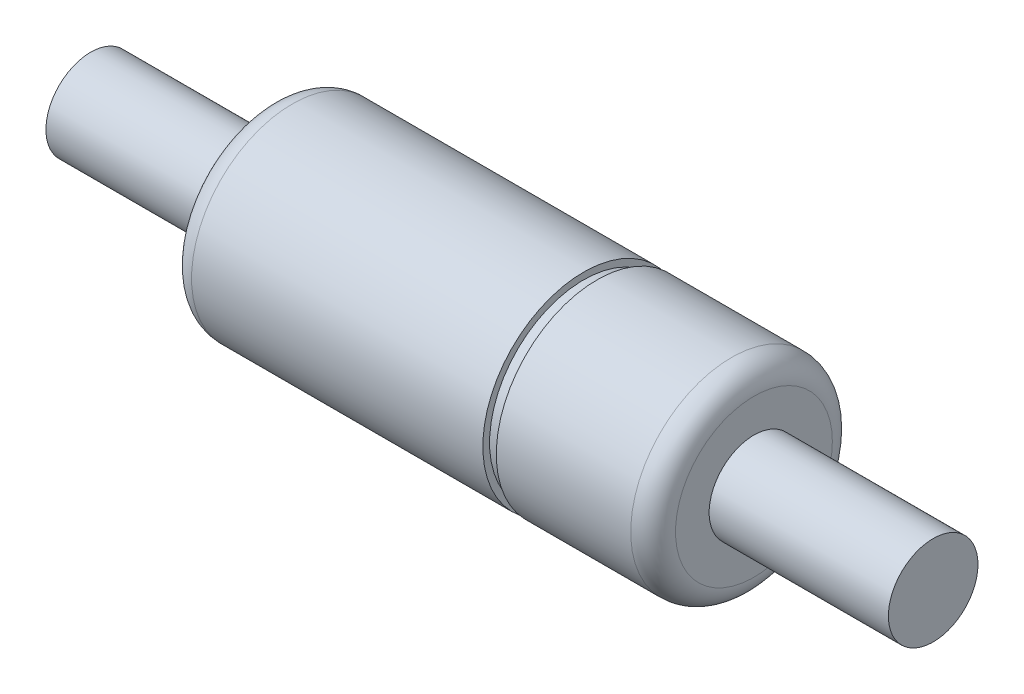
from build123d import *


with BuildPart() as part:
    # Skizze1 → Rotation3 (revolve)
    with BuildSketch(Plane.XY, mode=Mode.PRIVATE) as rotation3_sk:
        with BuildLine():
            Line((-10.8, 1), (-10.8, 1.75))
            ThreePointArc((-10.8, 1.75), (-10.653553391, 2.103553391), (-10.3, 2.25))
            Line((-10.3, 2.25), (-3.8, 2.25))
            Line((-3.8, 2.25), (-3.8, 2.1))
            Line((-3.8, 2.1), (-3.5, 2.1))
            Line((-3.5, 2.1), (-3.5, 2.25))
            Line((-3.5, 2.25), (-0.5, 2.25))
            ThreePointArc((-0.5, 2.25), (-0.146446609, 2.103553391), (0, 1.75))
            Line((0, 1.75), (0, 1))
            Line((0, 1), (4, 1))
            Line((4, 1), (4, 0))
            Line((4, 0), (-14.8, 0))
            Line((-14.8, 0), (-14.8, 1))
            Line((-14.8, 1), (-10.8, 1))
        make_face()
    revolve(rotation3_sk.sketch.rotate(Axis((2.974171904, 0, 0), (-1, 0, 0)), 90), axis=Axis((2.974171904, 0, 0), (-1, 0, 0)))


solid = part.part
